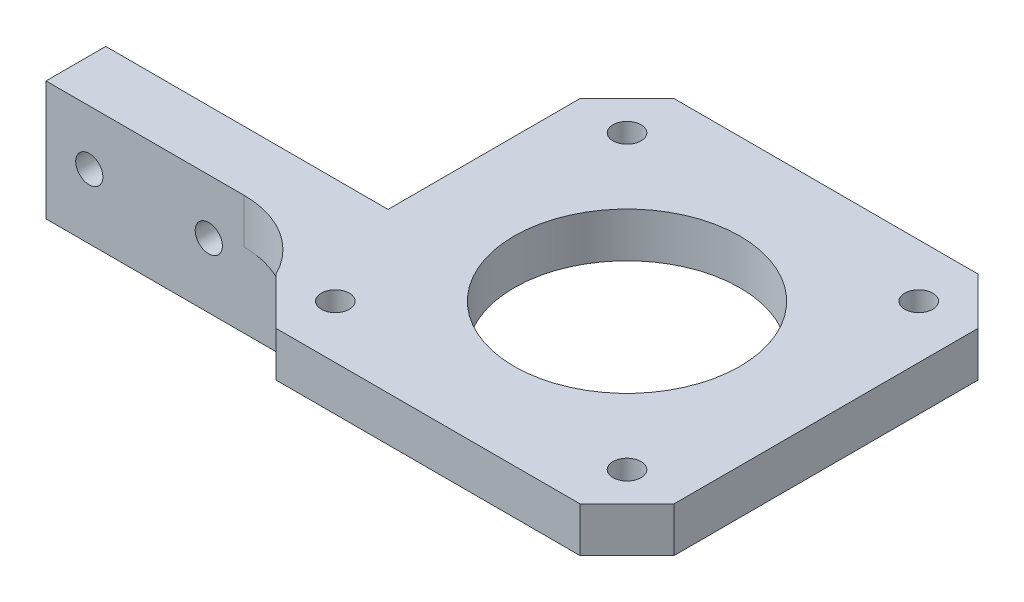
ISO-10303-21;
HEADER;
FILE_DESCRIPTION(('STEP AP214'),'2;1');
FILE_NAME('part.step','',(''),(''),'','','');
FILE_SCHEMA(('AUTOMOTIVE_DESIGN { 1 0 10303 214 1 1 1 1 }'));
ENDSEC;
DATA;
#1=APPLICATION_CONTEXT('core data for automotive mechanical design processes');
#2=APPLICATION_PROTOCOL_DEFINITION('international standard','automotive_design',2000,#1);
#3=PRODUCT_CONTEXT('',#1,'mechanical');
#4=PRODUCT('Part','Part','',(#3));
#5=PRODUCT_RELATED_PRODUCT_CATEGORY('part','',(#4));
#6=PRODUCT_DEFINITION_FORMATION('','',#4);
#7=PRODUCT_DEFINITION_CONTEXT('part definition',#1,'design');
#8=PRODUCT_DEFINITION('design','',#6,#7);
#9=PRODUCT_DEFINITION_SHAPE('','',#8);
#10=(LENGTH_UNIT() NAMED_UNIT(*) SI_UNIT(.MILLI.,.METRE.));
#11=(NAMED_UNIT(*) PLANE_ANGLE_UNIT() SI_UNIT($,.RADIAN.));
#12=(NAMED_UNIT(*) SI_UNIT($,.STERADIAN.) SOLID_ANGLE_UNIT());
#13=UNCERTAINTY_MEASURE_WITH_UNIT(LENGTH_MEASURE(1.E-05),#10,'distance_accuracy_value','');
#14=(GEOMETRIC_REPRESENTATION_CONTEXT(3) GLOBAL_UNCERTAINTY_ASSIGNED_CONTEXT((#13)) GLOBAL_UNIT_ASSIGNED_CONTEXT((#10,
#11,#12)) REPRESENTATION_CONTEXT('',''));
#15=CARTESIAN_POINT('',(0.,0.,0.));
#16=DIRECTION('',(0.,0.,1.));
#17=DIRECTION('',(1.,0.,0.));
#18=AXIS2_PLACEMENT_3D('',#15,#16,#17);
#19=CARTESIAN_POINT('',(-21.15,-4.7625,-16.15));
#20=DIRECTION('',(1.,0.,0.));
#21=DIRECTION('',(0.,0.,-1.));
#22=AXIS2_PLACEMENT_3D('',#19,#20,#21);
#23=PLANE('',#22);
#24=DIRECTION('',(0.,1.,0.));
#25=VECTOR('',#24,1.);
#26=CARTESIAN_POINT('',(-21.15,0.,4.24999999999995));
#27=LINE('',#26,#25);
#28=CARTESIAN_POINT('',(-21.15,-4.7625,4.24999999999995));
#29=VERTEX_POINT('',#28);
#30=CARTESIAN_POINT('',(-21.15,0.,4.24999999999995));
#31=VERTEX_POINT('',#30);
#32=EDGE_CURVE('E273',#29,#31,#27,.T.);
#33=ORIENTED_EDGE('',*,*,#32,.T.);
#34=DIRECTION('',(0.,0.,1.));
#35=VECTOR('',#34,1.);
#36=CARTESIAN_POINT('',(-21.15,0.,-16.15));
#37=LINE('',#36,#35);
#38=CARTESIAN_POINT('',(-21.15,0.,-16.15));
#39=VERTEX_POINT('',#38);
#40=EDGE_CURVE('E176',#39,#31,#37,.T.);
#41=ORIENTED_EDGE('',*,*,#40,.F.);
#42=DIRECTION('',(0.,1.,0.));
#43=VECTOR('',#42,1.);
#44=CARTESIAN_POINT('',(-21.15,-4.7625,-16.15));
#45=LINE('',#44,#43);
#46=CARTESIAN_POINT('',(-21.15,-4.7625,-16.15));
#47=VERTEX_POINT('',#46);
#48=EDGE_CURVE('E262',#47,#39,#45,.T.);
#49=ORIENTED_EDGE('',*,*,#48,.F.);
#50=DIRECTION('',(0.,0.,1.));
#51=VECTOR('',#50,1.);
#52=CARTESIAN_POINT('',(-21.15,-4.7625,-16.15));
#53=LINE('',#52,#51);
#54=EDGE_CURVE('E230',#47,#29,#53,.T.);
#55=ORIENTED_EDGE('',*,*,#54,.T.);
#56=EDGE_LOOP('',(#33,#41,#49,#55));
#57=FACE_BOUND('',#56,.T.);
#58=ADVANCED_FACE('F45',(#57),#23,.F.);
#59=CARTESIAN_POINT('',(0.,-4.7625,0.));
#60=DIRECTION('',(0.,-1.,0.));
#61=DIRECTION('',(0.,0.,1.));
#62=AXIS2_PLACEMENT_3D('',#59,#60,#61);
#63=PLANE('',#62);
#64=CARTESIAN_POINT('',(15.5,-4.7625,15.5));
#65=DIRECTION('',(0.,1.,0.));
#66=DIRECTION('',(0.,0.,1.));
#67=AXIS2_PLACEMENT_3D('',#64,#65,#66);
#68=CIRCLE('',#67,1.49);
#69=CARTESIAN_POINT('',(15.5,-4.7625,14.01));
#70=VERTEX_POINT('',#69);
#71=EDGE_CURVE('E191',#70,#70,#68,.T.);
#72=ORIENTED_EDGE('',*,*,#71,.T.);
#73=EDGE_LOOP('',(#72));
#74=FACE_BOUND('',#73,.T.);
#75=CARTESIAN_POINT('',(-15.5,-4.7625,-15.5));
#76=DIRECTION('',(0.,1.,0.));
#77=DIRECTION('',(0.,0.,1.));
#78=AXIS2_PLACEMENT_3D('',#75,#76,#77);
#79=CIRCLE('',#78,1.49);
#80=CARTESIAN_POINT('',(-15.5,-4.7625,-16.99));
#81=VERTEX_POINT('',#80);
#82=EDGE_CURVE('E203',#81,#81,#79,.T.);
#83=ORIENTED_EDGE('',*,*,#82,.T.);
#84=EDGE_LOOP('',(#83));
#85=FACE_BOUND('',#84,.T.);
#86=DIRECTION('',(0.,0.,1.));
#87=VECTOR('',#86,1.);
#88=CARTESIAN_POINT('',(-11.3650067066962,-4.7625,10.6));
#89=LINE('',#88,#87);
#90=CARTESIAN_POINT('',(-11.3650067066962,-4.7625,4.24999999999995));
#91=VERTEX_POINT('',#90);
#92=CARTESIAN_POINT('',(-11.3650067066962,-4.7625,10.6));
#93=VERTEX_POINT('',#92);
#94=EDGE_CURVE('E285',#91,#93,#89,.T.);
#95=ORIENTED_EDGE('',*,*,#94,.F.);
#96=DIRECTION('',(1.,0.,0.));
#97=VECTOR('',#96,1.);
#98=CARTESIAN_POINT('',(0.,-4.7625,4.24999999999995));
#99=LINE('',#98,#97);
#100=EDGE_CURVE('E62',#29,#91,#99,.T.);
#101=ORIENTED_EDGE('',*,*,#100,.F.);
#102=ORIENTED_EDGE('',*,*,#54,.F.);
#103=DIRECTION('',(-0.707106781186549,0.,0.707106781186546));
#104=VECTOR('',#103,1.);
#105=CARTESIAN_POINT('',(-16.15,-4.7625,-21.15));
#106=LINE('',#105,#104);
#107=CARTESIAN_POINT('',(-16.15,-4.7625,-21.15));
#108=VERTEX_POINT('',#107);
#109=EDGE_CURVE('E228',#108,#47,#106,.T.);
#110=ORIENTED_EDGE('',*,*,#109,.F.);
#111=DIRECTION('',(-1.,0.,0.));
#112=VECTOR('',#111,1.);
#113=CARTESIAN_POINT('',(16.15,-4.7625,-21.15));
#114=LINE('',#113,#112);
#115=CARTESIAN_POINT('',(16.15,-4.7625,-21.15));
#116=VERTEX_POINT('',#115);
#117=EDGE_CURVE('E225',#116,#108,#114,.T.);
#118=ORIENTED_EDGE('',*,*,#117,.F.);
#119=DIRECTION('',(-0.707106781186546,0.,-0.707106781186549));
#120=VECTOR('',#119,1.);
#121=CARTESIAN_POINT('',(21.15,-4.7625,-16.15));
#122=LINE('',#121,#120);
#123=CARTESIAN_POINT('',(21.15,-4.7625,-16.15));
#124=VERTEX_POINT('',#123);
#125=EDGE_CURVE('E222',#124,#116,#122,.T.);
#126=ORIENTED_EDGE('',*,*,#125,.F.);
#127=DIRECTION('',(0.,0.,-1.));
#128=VECTOR('',#127,1.);
#129=CARTESIAN_POINT('',(21.15,-4.7625,16.15));
#130=LINE('',#129,#128);
#131=CARTESIAN_POINT('',(21.15,-4.7625,16.15));
#132=VERTEX_POINT('',#131);
#133=EDGE_CURVE('E218',#132,#124,#130,.T.);
#134=ORIENTED_EDGE('',*,*,#133,.F.);
#135=DIRECTION('',(0.707106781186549,0.,-0.707106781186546));
#136=VECTOR('',#135,1.);
#137=CARTESIAN_POINT('',(16.15,-4.7625,21.15));
#138=LINE('',#137,#136);
#139=CARTESIAN_POINT('',(16.15,-4.7625,21.15));
#140=VERTEX_POINT('',#139);
#141=EDGE_CURVE('E215',#140,#132,#138,.T.);
#142=ORIENTED_EDGE('',*,*,#141,.F.);
#143=DIRECTION('',(1.,0.,0.));
#144=VECTOR('',#143,1.);
#145=CARTESIAN_POINT('',(-16.15,-4.7625,21.15));
#146=LINE('',#145,#144);
#147=CARTESIAN_POINT('',(-16.15,-4.7625,21.15));
#148=VERTEX_POINT('',#147);
#149=EDGE_CURVE('E235',#148,#140,#146,.T.);
#150=ORIENTED_EDGE('',*,*,#149,.F.);
#151=DIRECTION('',(0.707106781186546,0.,0.707106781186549));
#152=VECTOR('',#151,1.);
#153=CARTESIAN_POINT('',(-21.15,-4.7625,16.15));
#154=LINE('',#153,#152);
#155=CARTESIAN_POINT('',(-21.15,-4.7625,16.15));
#156=VERTEX_POINT('',#155);
#157=EDGE_CURVE('E232',#156,#148,#154,.T.);
#158=ORIENTED_EDGE('',*,*,#157,.F.);
#159=CARTESIAN_POINT('',(-30.1053056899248,-4.7625,20.6));
#160=DIRECTION('',(0.,1.,0.));
#161=DIRECTION('',(0.,0.,1.));
#162=AXIS2_PLACEMENT_3D('',#159,#160,#161);
#163=CIRCLE('',#162,10.);
#164=CARTESIAN_POINT('',(-30.1053056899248,-4.7625,10.6));
#165=VERTEX_POINT('',#164);
#166=EDGE_CURVE('E278',#165,#156,#163,.F.);
#167=ORIENTED_EDGE('',*,*,#166,.F.);
#168=DIRECTION('',(1.,0.,0.));
#169=VECTOR('',#168,1.);
#170=CARTESIAN_POINT('',(-51.15,-4.7625,10.6));
#171=LINE('',#170,#169);
#172=EDGE_CURVE('E274',#165,#93,#171,.T.);
#173=ORIENTED_EDGE('',*,*,#172,.T.);
#174=EDGE_LOOP('',(#95,#101,#102,#110,#118,#126,#134,#142,#150,#158,#167,#173));
#175=FACE_BOUND('',#174,.T.);
#176=CARTESIAN_POINT('',(0.,-4.7625,0.));
#177=DIRECTION('',(0.,1.,0.));
#178=DIRECTION('',(0.,0.,1.));
#179=AXIS2_PLACEMENT_3D('',#176,#177,#178);
#180=CIRCLE('',#179,12.);
#181=CARTESIAN_POINT('',(0.,-4.7625,-12.));
#182=VERTEX_POINT('',#181);
#183=EDGE_CURVE('E209',#182,#182,#180,.T.);
#184=ORIENTED_EDGE('',*,*,#183,.T.);
#185=EDGE_LOOP('',(#184));
#186=FACE_BOUND('',#185,.T.);
#187=CARTESIAN_POINT('',(15.5,-4.7625,-15.5));
#188=DIRECTION('',(0.,1.,0.));
#189=DIRECTION('',(0.,0.,1.));
#190=AXIS2_PLACEMENT_3D('',#187,#188,#189);
#191=CIRCLE('',#190,1.49);
#192=CARTESIAN_POINT('',(15.5,-4.7625,-16.99));
#193=VERTEX_POINT('',#192);
#194=EDGE_CURVE('E197',#193,#193,#191,.T.);
#195=ORIENTED_EDGE('',*,*,#194,.T.);
#196=EDGE_LOOP('',(#195));
#197=FACE_BOUND('',#196,.T.);
#198=CARTESIAN_POINT('',(-15.5,-4.7625,15.5));
#199=DIRECTION('',(0.,1.,0.));
#200=DIRECTION('',(0.,0.,1.));
#201=AXIS2_PLACEMENT_3D('',#198,#199,#200);
#202=CIRCLE('',#201,1.49);
#203=CARTESIAN_POINT('',(-15.5,-4.7625,14.01));
#204=VERTEX_POINT('',#203);
#205=EDGE_CURVE('E182',#204,#204,#202,.T.);
#206=ORIENTED_EDGE('',*,*,#205,.T.);
#207=EDGE_LOOP('',(#206));
#208=FACE_BOUND('',#207,.T.);
#209=ADVANCED_FACE('F311',(#74,#85,#175,#186,#197,#208),#63,.T.);
#210=CARTESIAN_POINT('',(0.,0.,0.));
#211=DIRECTION('',(0.,-1.,0.));
#212=DIRECTION('',(0.,0.,1.));
#213=AXIS2_PLACEMENT_3D('',#210,#211,#212);
#214=PLANE('',#213);
#215=DIRECTION('',(0.707106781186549,0.,-0.707106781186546));
#216=VECTOR('',#215,1.);
#217=CARTESIAN_POINT('',(16.15,0.,21.15));
#218=LINE('',#217,#216);
#219=CARTESIAN_POINT('',(16.15,0.,21.15));
#220=VERTEX_POINT('',#219);
#221=CARTESIAN_POINT('',(21.15,0.,16.15));
#222=VERTEX_POINT('',#221);
#223=EDGE_CURVE('E212',#220,#222,#218,.T.);
#224=ORIENTED_EDGE('',*,*,#223,.T.);
#225=DIRECTION('',(0.,0.,-1.));
#226=VECTOR('',#225,1.);
#227=CARTESIAN_POINT('',(21.15,0.,16.15));
#228=LINE('',#227,#226);
#229=CARTESIAN_POINT('',(21.15,0.,-16.15));
#230=VERTEX_POINT('',#229);
#231=EDGE_CURVE('E240',#222,#230,#228,.T.);
#232=ORIENTED_EDGE('',*,*,#231,.T.);
#233=DIRECTION('',(-0.707106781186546,0.,-0.707106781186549));
#234=VECTOR('',#233,1.);
#235=CARTESIAN_POINT('',(21.15,0.,-16.15));
#236=LINE('',#235,#234);
#237=CARTESIAN_POINT('',(16.15,0.,-21.15));
#238=VERTEX_POINT('',#237);
#239=EDGE_CURVE('E243',#230,#238,#236,.T.);
#240=ORIENTED_EDGE('',*,*,#239,.T.);
#241=DIRECTION('',(-1.,0.,0.));
#242=VECTOR('',#241,1.);
#243=CARTESIAN_POINT('',(16.15,0.,-21.15));
#244=LINE('',#243,#242);
#245=CARTESIAN_POINT('',(-16.15,0.,-21.15));
#246=VERTEX_POINT('',#245);
#247=EDGE_CURVE('E246',#238,#246,#244,.T.);
#248=ORIENTED_EDGE('',*,*,#247,.T.);
#249=DIRECTION('',(-0.707106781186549,0.,0.707106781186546));
#250=VECTOR('',#249,1.);
#251=CARTESIAN_POINT('',(-16.15,0.,-21.15));
#252=LINE('',#251,#250);
#253=EDGE_CURVE('E249',#246,#39,#252,.T.);
#254=ORIENTED_EDGE('',*,*,#253,.T.);
#255=ORIENTED_EDGE('',*,*,#40,.T.);
#256=DIRECTION('',(1.,0.,0.));
#257=VECTOR('',#256,1.);
#258=CARTESIAN_POINT('',(-51.15,0.,4.24999999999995));
#259=LINE('',#258,#257);
#260=CARTESIAN_POINT('',(-51.15,0.,4.24999999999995));
#261=VERTEX_POINT('',#260);
#262=EDGE_CURVE('E155',#261,#31,#259,.T.);
#263=ORIENTED_EDGE('',*,*,#262,.F.);
#264=DIRECTION('',(0.,0.,1.));
#265=VECTOR('',#264,1.);
#266=CARTESIAN_POINT('',(-51.15,0.,4.24999999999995));
#267=LINE('',#266,#265);
#268=CARTESIAN_POINT('',(-51.15,0.,10.6));
#269=VERTEX_POINT('',#268);
#270=EDGE_CURVE('E161',#261,#269,#267,.T.);
#271=ORIENTED_EDGE('',*,*,#270,.T.);
#272=DIRECTION('',(1.,0.,0.));
#273=VECTOR('',#272,1.);
#274=CARTESIAN_POINT('',(-51.15,0.,10.6));
#275=LINE('',#274,#273);
#276=CARTESIAN_POINT('',(-30.1053056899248,0.,10.6));
#277=VERTEX_POINT('',#276);
#278=EDGE_CURVE('E179',#269,#277,#275,.T.);
#279=ORIENTED_EDGE('',*,*,#278,.T.);
#280=CARTESIAN_POINT('',(-30.1053056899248,0.,20.6));
#281=DIRECTION('',(0.,1.,0.));
#282=DIRECTION('',(0.,0.,1.));
#283=AXIS2_PLACEMENT_3D('',#280,#281,#282);
#284=CIRCLE('',#283,10.);
#285=CARTESIAN_POINT('',(-21.15,0.,16.15));
#286=VERTEX_POINT('',#285);
#287=EDGE_CURVE('E281',#286,#277,#284,.T.);
#288=ORIENTED_EDGE('',*,*,#287,.F.);
#289=DIRECTION('',(0.707106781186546,0.,0.707106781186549));
#290=VECTOR('',#289,1.);
#291=CARTESIAN_POINT('',(-21.15,0.,16.15));
#292=LINE('',#291,#290);
#293=CARTESIAN_POINT('',(-16.15,0.,21.15));
#294=VERTEX_POINT('',#293);
#295=EDGE_CURVE('E252',#286,#294,#292,.T.);
#296=ORIENTED_EDGE('',*,*,#295,.T.);
#297=DIRECTION('',(1.,0.,0.));
#298=VECTOR('',#297,1.);
#299=CARTESIAN_POINT('',(-16.15,0.,21.15));
#300=LINE('',#299,#298);
#301=EDGE_CURVE('E219',#294,#220,#300,.T.);
#302=ORIENTED_EDGE('',*,*,#301,.T.);
#303=EDGE_LOOP('',(#224,#232,#240,#248,#254,#255,#263,#271,#279,#288,#296,#302));
#304=FACE_BOUND('',#303,.T.);
#305=CARTESIAN_POINT('',(0.,0.,0.));
#306=DIRECTION('',(0.,1.,0.));
#307=DIRECTION('',(0.,0.,1.));
#308=AXIS2_PLACEMENT_3D('',#305,#306,#307);
#309=CIRCLE('',#308,12.);
#310=CARTESIAN_POINT('',(0.,0.,-12.));
#311=VERTEX_POINT('',#310);
#312=EDGE_CURVE('E206',#311,#311,#309,.T.);
#313=ORIENTED_EDGE('',*,*,#312,.F.);
#314=EDGE_LOOP('',(#313));
#315=FACE_BOUND('',#314,.T.);
#316=CARTESIAN_POINT('',(-15.5,0.,-15.5));
#317=DIRECTION('',(0.,1.,0.));
#318=DIRECTION('',(0.,0.,1.));
#319=AXIS2_PLACEMENT_3D('',#316,#317,#318);
#320=CIRCLE('',#319,1.49);
#321=CARTESIAN_POINT('',(-15.5,0.,-16.99));
#322=VERTEX_POINT('',#321);
#323=EDGE_CURVE('E200',#322,#322,#320,.T.);
#324=ORIENTED_EDGE('',*,*,#323,.F.);
#325=EDGE_LOOP('',(#324));
#326=FACE_BOUND('',#325,.T.);
#327=CARTESIAN_POINT('',(15.5,0.,-15.5));
#328=DIRECTION('',(0.,1.,0.));
#329=DIRECTION('',(0.,0.,1.));
#330=AXIS2_PLACEMENT_3D('',#327,#328,#329);
#331=CIRCLE('',#330,1.49);
#332=CARTESIAN_POINT('',(15.5,0.,-16.99));
#333=VERTEX_POINT('',#332);
#334=EDGE_CURVE('E194',#333,#333,#331,.T.);
#335=ORIENTED_EDGE('',*,*,#334,.F.);
#336=EDGE_LOOP('',(#335));
#337=FACE_BOUND('',#336,.T.);
#338=CARTESIAN_POINT('',(15.5,0.,15.5));
#339=DIRECTION('',(0.,1.,0.));
#340=DIRECTION('',(0.,0.,1.));
#341=AXIS2_PLACEMENT_3D('',#338,#339,#340);
#342=CIRCLE('',#341,1.49);
#343=CARTESIAN_POINT('',(15.5,0.,14.01));
#344=VERTEX_POINT('',#343);
#345=EDGE_CURVE('E189',#344,#344,#342,.T.);
#346=ORIENTED_EDGE('',*,*,#345,.F.);
#347=EDGE_LOOP('',(#346));
#348=FACE_BOUND('',#347,.T.);
#349=CARTESIAN_POINT('',(-15.5,0.,15.5));
#350=DIRECTION('',(0.,1.,0.));
#351=DIRECTION('',(0.,0.,1.));
#352=AXIS2_PLACEMENT_3D('',#349,#350,#351);
#353=CIRCLE('',#352,1.49);
#354=CARTESIAN_POINT('',(-15.5,0.,14.01));
#355=VERTEX_POINT('',#354);
#356=EDGE_CURVE('E178',#355,#355,#353,.T.);
#357=ORIENTED_EDGE('',*,*,#356,.F.);
#358=EDGE_LOOP('',(#357));
#359=FACE_BOUND('',#358,.T.);
#360=ADVANCED_FACE('F173',(#304,#315,#326,#337,#348,#359),#214,.F.);
#361=CARTESIAN_POINT('',(16.15,-4.7625,21.15));
#362=DIRECTION('',(-0.707106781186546,0.,-0.707106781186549));
#363=DIRECTION('',(-0.707106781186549,0.,0.707106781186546));
#364=AXIS2_PLACEMENT_3D('',#361,#362,#363);
#365=PLANE('',#364);
#366=ORIENTED_EDGE('',*,*,#223,.F.);
#367=DIRECTION('',(0.,1.,0.));
#368=VECTOR('',#367,1.);
#369=CARTESIAN_POINT('',(16.15,-4.7625,21.15));
#370=LINE('',#369,#368);
#371=EDGE_CURVE('E238',#140,#220,#370,.T.);
#372=ORIENTED_EDGE('',*,*,#371,.F.);
#373=ORIENTED_EDGE('',*,*,#141,.T.);
#374=DIRECTION('',(0.,1.,0.));
#375=VECTOR('',#374,1.);
#376=CARTESIAN_POINT('',(21.15,-4.7625,16.15));
#377=LINE('',#376,#375);
#378=EDGE_CURVE('E271',#132,#222,#377,.T.);
#379=ORIENTED_EDGE('',*,*,#378,.T.);
#380=EDGE_LOOP('',(#366,#372,#373,#379));
#381=FACE_BOUND('',#380,.T.);
#382=ADVANCED_FACE('F328',(#381),#365,.F.);
#383=CARTESIAN_POINT('',(21.15,-4.7625,16.15));
#384=DIRECTION('',(-1.,0.,0.));
#385=DIRECTION('',(0.,0.,1.));
#386=AXIS2_PLACEMENT_3D('',#383,#384,#385);
#387=PLANE('',#386);
#388=ORIENTED_EDGE('',*,*,#231,.F.);
#389=ORIENTED_EDGE('',*,*,#378,.F.);
#390=ORIENTED_EDGE('',*,*,#133,.T.);
#391=DIRECTION('',(0.,1.,0.));
#392=VECTOR('',#391,1.);
#393=CARTESIAN_POINT('',(21.15,-4.7625,-16.15));
#394=LINE('',#393,#392);
#395=EDGE_CURVE('E269',#124,#230,#394,.T.);
#396=ORIENTED_EDGE('',*,*,#395,.T.);
#397=EDGE_LOOP('',(#388,#389,#390,#396));
#398=FACE_BOUND('',#397,.T.);
#399=ADVANCED_FACE('F333',(#398),#387,.F.);
#400=CARTESIAN_POINT('',(21.15,-4.7625,-16.15));
#401=DIRECTION('',(-0.707106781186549,0.,0.707106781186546));
#402=DIRECTION('',(0.707106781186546,0.,0.707106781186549));
#403=AXIS2_PLACEMENT_3D('',#400,#401,#402);
#404=PLANE('',#403);
#405=ORIENTED_EDGE('',*,*,#239,.F.);
#406=ORIENTED_EDGE('',*,*,#395,.F.);
#407=ORIENTED_EDGE('',*,*,#125,.T.);
#408=DIRECTION('',(0.,1.,0.));
#409=VECTOR('',#408,1.);
#410=CARTESIAN_POINT('',(16.15,-4.7625,-21.15));
#411=LINE('',#410,#409);
#412=EDGE_CURVE('E267',#116,#238,#411,.T.);
#413=ORIENTED_EDGE('',*,*,#412,.T.);
#414=EDGE_LOOP('',(#405,#406,#407,#413));
#415=FACE_BOUND('',#414,.T.);
#416=ADVANCED_FACE('F336',(#415),#404,.F.);
#417=CARTESIAN_POINT('',(16.15,-4.7625,-21.15));
#418=DIRECTION('',(0.,0.,1.));
#419=DIRECTION('',(1.,0.,0.));
#420=AXIS2_PLACEMENT_3D('',#417,#418,#419);
#421=PLANE('',#420);
#422=ORIENTED_EDGE('',*,*,#247,.F.);
#423=ORIENTED_EDGE('',*,*,#412,.F.);
#424=ORIENTED_EDGE('',*,*,#117,.T.);
#425=DIRECTION('',(0.,1.,0.));
#426=VECTOR('',#425,1.);
#427=CARTESIAN_POINT('',(-16.15,-4.7625,-21.15));
#428=LINE('',#427,#426);
#429=EDGE_CURVE('E265',#108,#246,#428,.T.);
#430=ORIENTED_EDGE('',*,*,#429,.T.);
#431=EDGE_LOOP('',(#422,#423,#424,#430));
#432=FACE_BOUND('',#431,.T.);
#433=ADVANCED_FACE('F340',(#432),#421,.F.);
#434=CARTESIAN_POINT('',(-16.15,-4.7625,-21.15));
#435=DIRECTION('',(0.707106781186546,0.,0.707106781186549));
#436=DIRECTION('',(0.707106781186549,0.,-0.707106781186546));
#437=AXIS2_PLACEMENT_3D('',#434,#435,#436);
#438=PLANE('',#437);
#439=ORIENTED_EDGE('',*,*,#253,.F.);
#440=ORIENTED_EDGE('',*,*,#429,.F.);
#441=ORIENTED_EDGE('',*,*,#109,.T.);
#442=ORIENTED_EDGE('',*,*,#48,.T.);
#443=EDGE_LOOP('',(#439,#440,#441,#442));
#444=FACE_BOUND('',#443,.T.);
#445=ADVANCED_FACE('F344',(#444),#438,.F.);
#446=CARTESIAN_POINT('',(-21.15,-4.7625,16.15));
#447=DIRECTION('',(0.707106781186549,0.,-0.707106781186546));
#448=DIRECTION('',(-0.707106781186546,0.,-0.707106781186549));
#449=AXIS2_PLACEMENT_3D('',#446,#447,#448);
#450=PLANE('',#449);
#451=ORIENTED_EDGE('',*,*,#295,.F.);
#452=DIRECTION('',(0.,1.,0.));
#453=VECTOR('',#452,1.);
#454=CARTESIAN_POINT('',(-21.15,-4.7625,16.15));
#455=LINE('',#454,#453);
#456=EDGE_CURVE('E260',#156,#286,#455,.T.);
#457=ORIENTED_EDGE('',*,*,#456,.F.);
#458=ORIENTED_EDGE('',*,*,#157,.T.);
#459=DIRECTION('',(0.,1.,0.));
#460=VECTOR('',#459,1.);
#461=CARTESIAN_POINT('',(-16.15,-4.7625,21.15));
#462=LINE('',#461,#460);
#463=EDGE_CURVE('E258',#148,#294,#462,.T.);
#464=ORIENTED_EDGE('',*,*,#463,.T.);
#465=EDGE_LOOP('',(#451,#457,#458,#464));
#466=FACE_BOUND('',#465,.T.);
#467=ADVANCED_FACE('F322',(#466),#450,.F.);
#468=CARTESIAN_POINT('',(-16.15,-4.7625,21.15));
#469=DIRECTION('',(0.,0.,-1.));
#470=DIRECTION('',(-1.,0.,0.));
#471=AXIS2_PLACEMENT_3D('',#468,#469,#470);
#472=PLANE('',#471);
#473=ORIENTED_EDGE('',*,*,#301,.F.);
#474=ORIENTED_EDGE('',*,*,#463,.F.);
#475=ORIENTED_EDGE('',*,*,#149,.T.);
#476=ORIENTED_EDGE('',*,*,#371,.T.);
#477=EDGE_LOOP('',(#473,#474,#475,#476));
#478=FACE_BOUND('',#477,.T.);
#479=ADVANCED_FACE('F325',(#478),#472,.F.);
#480=CARTESIAN_POINT('',(0.,-4.7625,0.));
#481=DIRECTION('',(0.,1.,0.));
#482=DIRECTION('',(0.,0.,-1.));
#483=AXIS2_PLACEMENT_3D('',#480,#481,#482);
#484=CYLINDRICAL_SURFACE('',#483,12.);
#485=CARTESIAN_POINT('',(0.,-4.7625,-12.));
#486=CARTESIAN_POINT('',(0.,-4.712890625,-12.));
#487=CARTESIAN_POINT('',(0.,-4.66328125,-12.));
#488=CARTESIAN_POINT('',(0.,-4.5640625,-12.));
#489=CARTESIAN_POINT('',(0.,-4.514453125,-12.));
#490=CARTESIAN_POINT('',(0.,-4.415234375,-12.));
#491=CARTESIAN_POINT('',(0.,-4.365625,-12.));
#492=CARTESIAN_POINT('',(0.,-4.26640625,-12.));
#493=CARTESIAN_POINT('',(0.,-4.216796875,-12.));
#494=CARTESIAN_POINT('',(0.,-4.117578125,-12.));
#495=CARTESIAN_POINT('',(0.,-4.06796875,-12.));
#496=CARTESIAN_POINT('',(0.,-3.96875,-12.));
#497=CARTESIAN_POINT('',(0.,-3.919140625,-12.));
#498=CARTESIAN_POINT('',(0.,-3.819921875,-12.));
#499=CARTESIAN_POINT('',(0.,-3.7703125,-12.));
#500=CARTESIAN_POINT('',(0.,-3.67109375,-12.));
#501=CARTESIAN_POINT('',(0.,-3.621484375,-12.));
#502=CARTESIAN_POINT('',(0.,-3.522265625,-12.));
#503=CARTESIAN_POINT('',(0.,-3.47265625,-12.));
#504=CARTESIAN_POINT('',(0.,-3.3734375,-12.));
#505=CARTESIAN_POINT('',(0.,-3.323828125,-12.));
#506=CARTESIAN_POINT('',(0.,-3.224609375,-12.));
#507=CARTESIAN_POINT('',(0.,-3.175,-12.));
#508=CARTESIAN_POINT('',(0.,-3.07578125,-12.));
#509=CARTESIAN_POINT('',(0.,-3.026171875,-12.));
#510=CARTESIAN_POINT('',(0.,-2.926953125,-12.));
#511=CARTESIAN_POINT('',(0.,-2.87734375,-12.));
#512=CARTESIAN_POINT('',(0.,-2.778125,-12.));
#513=CARTESIAN_POINT('',(0.,-2.728515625,-12.));
#514=CARTESIAN_POINT('',(0.,-2.629296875,-12.));
#515=CARTESIAN_POINT('',(0.,-2.5796875,-12.));
#516=CARTESIAN_POINT('',(0.,-2.48046875,-12.));
#517=CARTESIAN_POINT('',(0.,-2.430859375,-12.));
#518=CARTESIAN_POINT('',(0.,-2.331640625,-12.));
#519=CARTESIAN_POINT('',(0.,-2.28203125,-12.));
#520=CARTESIAN_POINT('',(0.,-2.1828125,-12.));
#521=CARTESIAN_POINT('',(0.,-2.133203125,-12.));
#522=CARTESIAN_POINT('',(0.,-2.033984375,-12.));
#523=CARTESIAN_POINT('',(0.,-1.984375,-12.));
#524=CARTESIAN_POINT('',(0.,-1.88515625,-12.));
#525=CARTESIAN_POINT('',(0.,-1.835546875,-12.));
#526=CARTESIAN_POINT('',(0.,-1.736328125,-12.));
#527=CARTESIAN_POINT('',(0.,-1.68671875,-12.));
#528=CARTESIAN_POINT('',(0.,-1.5875,-12.));
#529=CARTESIAN_POINT('',(0.,-1.537890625,-12.));
#530=CARTESIAN_POINT('',(0.,-1.438671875,-12.));
#531=CARTESIAN_POINT('',(0.,-1.3890625,-12.));
#532=CARTESIAN_POINT('',(0.,-1.28984375,-12.));
#533=CARTESIAN_POINT('',(0.,-1.240234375,-12.));
#534=CARTESIAN_POINT('',(0.,-1.141015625,-12.));
#535=CARTESIAN_POINT('',(0.,-1.09140625,-12.));
#536=CARTESIAN_POINT('',(0.,-0.9921875,-12.));
#537=CARTESIAN_POINT('',(0.,-0.942578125,-12.));
#538=CARTESIAN_POINT('',(0.,-0.843359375,-12.));
#539=CARTESIAN_POINT('',(0.,-0.79375,-12.));
#540=CARTESIAN_POINT('',(0.,-0.69453125,-12.));
#541=CARTESIAN_POINT('',(0.,-0.644921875,-12.));
#542=CARTESIAN_POINT('',(0.,-0.545703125,-12.));
#543=CARTESIAN_POINT('',(0.,-0.49609375,-12.));
#544=CARTESIAN_POINT('',(0.,-0.396875,-12.));
#545=CARTESIAN_POINT('',(0.,-0.347265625,-12.));
#546=CARTESIAN_POINT('',(0.,-0.248046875,-12.));
#547=CARTESIAN_POINT('',(0.,-0.1984375,-12.));
#548=CARTESIAN_POINT('',(0.,-0.09921875,-12.));
#549=CARTESIAN_POINT('',(0.,-0.049609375,-12.));
#550=CARTESIAN_POINT('',(0.,0.,-12.));
#551=B_SPLINE_CURVE_WITH_KNOTS('',3,(#485,#486,#487,#488,#489,#490,#491,#492,#493,#494,#495,
#496,#497,#498,#499,#500,#501,#502,#503,#504,#505,#506,#507,#508,#509,#510,#511,#512,#513,#514,
#515,#516,#517,#518,#519,#520,#521,#522,#523,#524,#525,#526,#527,#528,#529,#530,#531,#532,#533,
#534,#535,#536,#537,#538,#539,#540,#541,#542,#543,#544,#545,#546,#547,#548,#549,#550),
.UNSPECIFIED.,.F.,.F.,(4,2,2,2,2,2,2,2,2,2,2,2,2,2,2,2,2,2,2,2,2,2,2,2,2,2,2,2,2,2,2,2,4),(0.,
0.148828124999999,0.297656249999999,0.446484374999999,0.595312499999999,0.744140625,0.89296875,
1.041796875,1.190625,1.339453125,1.48828125,1.637109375,1.7859375,1.934765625,2.08359375,
2.232421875,2.38125,2.530078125,2.67890625,2.827734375,2.9765625,3.125390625,3.27421875,
3.423046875,3.571875,3.720703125,3.86953125,4.018359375,4.1671875,4.316015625,4.46484375,
4.613671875,4.7625),.UNSPECIFIED.);
#552=EDGE_CURVE('BSEAM401',#182,#311,#551,.T.);
#553=ORIENTED_EDGE('',*,*,#183,.F.);
#554=ORIENTED_EDGE('',*,*,#312,.T.);
#555=ORIENTED_EDGE('',*,*,#552,.T.);
#556=ORIENTED_EDGE('',*,*,#552,.F.);
#557=EDGE_LOOP('',(#553,#555,#554,#556));
#558=FACE_BOUND('',#557,.T.);
#559=ADVANCED_FACE('F401',(#558),#484,.F.);
#560=CARTESIAN_POINT('',(-15.5,-4.7625,-15.5));
#561=DIRECTION('',(0.,1.,0.));
#562=DIRECTION('',(0.,0.,-1.));
#563=AXIS2_PLACEMENT_3D('',#560,#561,#562);
#564=CYLINDRICAL_SURFACE('',#563,1.49);
#565=CARTESIAN_POINT('',(-15.5,-4.7625,-16.99));
#566=CARTESIAN_POINT('',(-15.5,-4.712890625,-16.99));
#567=CARTESIAN_POINT('',(-15.5,-4.66328125,-16.99));
#568=CARTESIAN_POINT('',(-15.5,-4.5640625,-16.99));
#569=CARTESIAN_POINT('',(-15.5,-4.514453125,-16.99));
#570=CARTESIAN_POINT('',(-15.5,-4.415234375,-16.99));
#571=CARTESIAN_POINT('',(-15.5,-4.365625,-16.99));
#572=CARTESIAN_POINT('',(-15.5,-4.26640625,-16.99));
#573=CARTESIAN_POINT('',(-15.5,-4.216796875,-16.99));
#574=CARTESIAN_POINT('',(-15.5,-4.117578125,-16.99));
#575=CARTESIAN_POINT('',(-15.5,-4.06796875,-16.99));
#576=CARTESIAN_POINT('',(-15.5,-3.96875,-16.99));
#577=CARTESIAN_POINT('',(-15.5,-3.919140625,-16.99));
#578=CARTESIAN_POINT('',(-15.5,-3.819921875,-16.99));
#579=CARTESIAN_POINT('',(-15.5,-3.7703125,-16.99));
#580=CARTESIAN_POINT('',(-15.5,-3.67109375,-16.99));
#581=CARTESIAN_POINT('',(-15.5,-3.621484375,-16.99));
#582=CARTESIAN_POINT('',(-15.5,-3.522265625,-16.99));
#583=CARTESIAN_POINT('',(-15.5,-3.47265625,-16.99));
#584=CARTESIAN_POINT('',(-15.5,-3.3734375,-16.99));
#585=CARTESIAN_POINT('',(-15.5,-3.323828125,-16.99));
#586=CARTESIAN_POINT('',(-15.5,-3.224609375,-16.99));
#587=CARTESIAN_POINT('',(-15.5,-3.175,-16.99));
#588=CARTESIAN_POINT('',(-15.5,-3.07578125,-16.99));
#589=CARTESIAN_POINT('',(-15.5,-3.026171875,-16.99));
#590=CARTESIAN_POINT('',(-15.5,-2.926953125,-16.99));
#591=CARTESIAN_POINT('',(-15.5,-2.87734375,-16.99));
#592=CARTESIAN_POINT('',(-15.5,-2.778125,-16.99));
#593=CARTESIAN_POINT('',(-15.5,-2.728515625,-16.99));
#594=CARTESIAN_POINT('',(-15.5,-2.629296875,-16.99));
#595=CARTESIAN_POINT('',(-15.5,-2.5796875,-16.99));
#596=CARTESIAN_POINT('',(-15.5,-2.48046875,-16.99));
#597=CARTESIAN_POINT('',(-15.5,-2.430859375,-16.99));
#598=CARTESIAN_POINT('',(-15.5,-2.331640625,-16.99));
#599=CARTESIAN_POINT('',(-15.5,-2.28203125,-16.99));
#600=CARTESIAN_POINT('',(-15.5,-2.1828125,-16.99));
#601=CARTESIAN_POINT('',(-15.5,-2.133203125,-16.99));
#602=CARTESIAN_POINT('',(-15.5,-2.033984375,-16.99));
#603=CARTESIAN_POINT('',(-15.5,-1.984375,-16.99));
#604=CARTESIAN_POINT('',(-15.5,-1.88515625,-16.99));
#605=CARTESIAN_POINT('',(-15.5,-1.835546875,-16.99));
#606=CARTESIAN_POINT('',(-15.5,-1.736328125,-16.99));
#607=CARTESIAN_POINT('',(-15.5,-1.68671875,-16.99));
#608=CARTESIAN_POINT('',(-15.5,-1.5875,-16.99));
#609=CARTESIAN_POINT('',(-15.5,-1.537890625,-16.99));
#610=CARTESIAN_POINT('',(-15.5,-1.438671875,-16.99));
#611=CARTESIAN_POINT('',(-15.5,-1.3890625,-16.99));
#612=CARTESIAN_POINT('',(-15.5,-1.28984375,-16.99));
#613=CARTESIAN_POINT('',(-15.5,-1.240234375,-16.99));
#614=CARTESIAN_POINT('',(-15.5,-1.141015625,-16.99));
#615=CARTESIAN_POINT('',(-15.5,-1.09140625,-16.99));
#616=CARTESIAN_POINT('',(-15.5,-0.9921875,-16.99));
#617=CARTESIAN_POINT('',(-15.5,-0.942578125,-16.99));
#618=CARTESIAN_POINT('',(-15.5,-0.843359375,-16.99));
#619=CARTESIAN_POINT('',(-15.5,-0.79375,-16.99));
#620=CARTESIAN_POINT('',(-15.5,-0.69453125,-16.99));
#621=CARTESIAN_POINT('',(-15.5,-0.644921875,-16.99));
#622=CARTESIAN_POINT('',(-15.5,-0.545703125,-16.99));
#623=CARTESIAN_POINT('',(-15.5,-0.49609375,-16.99));
#624=CARTESIAN_POINT('',(-15.5,-0.396875,-16.99));
#625=CARTESIAN_POINT('',(-15.5,-0.347265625,-16.99));
#626=CARTESIAN_POINT('',(-15.5,-0.248046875,-16.99));
#627=CARTESIAN_POINT('',(-15.5,-0.1984375,-16.99));
#628=CARTESIAN_POINT('',(-15.5,-0.09921875,-16.99));
#629=CARTESIAN_POINT('',(-15.5,-0.049609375,-16.99));
#630=CARTESIAN_POINT('',(-15.5,0.,-16.99));
#631=B_SPLINE_CURVE_WITH_KNOTS('',3,(#565,#566,#567,#568,#569,#570,#571,#572,#573,#574,#575,
#576,#577,#578,#579,#580,#581,#582,#583,#584,#585,#586,#587,#588,#589,#590,#591,#592,#593,#594,
#595,#596,#597,#598,#599,#600,#601,#602,#603,#604,#605,#606,#607,#608,#609,#610,#611,#612,#613,
#614,#615,#616,#617,#618,#619,#620,#621,#622,#623,#624,#625,#626,#627,#628,#629,#630),
.UNSPECIFIED.,.F.,.F.,(4,2,2,2,2,2,2,2,2,2,2,2,2,2,2,2,2,2,2,2,2,2,2,2,2,2,2,2,2,2,2,2,4),(0.,
0.148828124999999,0.297656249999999,0.446484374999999,0.595312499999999,0.744140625,0.89296875,
1.041796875,1.190625,1.339453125,1.48828125,1.637109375,1.7859375,1.934765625,2.08359375,
2.232421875,2.38125,2.530078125,2.67890625,2.827734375,2.9765625,3.125390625,3.27421875,
3.423046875,3.571875,3.720703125,3.86953125,4.018359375,4.1671875,4.316015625,4.46484375,
4.613671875,4.7625),.UNSPECIFIED.);
#632=EDGE_CURVE('BSEAM397',#81,#322,#631,.T.);
#633=ORIENTED_EDGE('',*,*,#82,.F.);
#634=ORIENTED_EDGE('',*,*,#323,.T.);
#635=ORIENTED_EDGE('',*,*,#632,.T.);
#636=ORIENTED_EDGE('',*,*,#632,.F.);
#637=EDGE_LOOP('',(#633,#635,#634,#636));
#638=FACE_BOUND('',#637,.T.);
#639=ADVANCED_FACE('F397',(#638),#564,.F.);
#640=CARTESIAN_POINT('',(15.5,-4.7625,-15.5));
#641=DIRECTION('',(0.,1.,0.));
#642=DIRECTION('',(0.,0.,-1.));
#643=AXIS2_PLACEMENT_3D('',#640,#641,#642);
#644=CYLINDRICAL_SURFACE('',#643,1.49);
#645=CARTESIAN_POINT('',(15.5,-4.7625,-16.99));
#646=CARTESIAN_POINT('',(15.5,-4.712890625,-16.99));
#647=CARTESIAN_POINT('',(15.5,-4.66328125,-16.99));
#648=CARTESIAN_POINT('',(15.5,-4.5640625,-16.99));
#649=CARTESIAN_POINT('',(15.5,-4.514453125,-16.99));
#650=CARTESIAN_POINT('',(15.5,-4.415234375,-16.99));
#651=CARTESIAN_POINT('',(15.5,-4.365625,-16.99));
#652=CARTESIAN_POINT('',(15.5,-4.26640625,-16.99));
#653=CARTESIAN_POINT('',(15.5,-4.216796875,-16.99));
#654=CARTESIAN_POINT('',(15.5,-4.117578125,-16.99));
#655=CARTESIAN_POINT('',(15.5,-4.06796875,-16.99));
#656=CARTESIAN_POINT('',(15.5,-3.96875,-16.99));
#657=CARTESIAN_POINT('',(15.5,-3.919140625,-16.99));
#658=CARTESIAN_POINT('',(15.5,-3.819921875,-16.99));
#659=CARTESIAN_POINT('',(15.5,-3.7703125,-16.99));
#660=CARTESIAN_POINT('',(15.5,-3.67109375,-16.99));
#661=CARTESIAN_POINT('',(15.5,-3.621484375,-16.99));
#662=CARTESIAN_POINT('',(15.5,-3.522265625,-16.99));
#663=CARTESIAN_POINT('',(15.5,-3.47265625,-16.99));
#664=CARTESIAN_POINT('',(15.5,-3.3734375,-16.99));
#665=CARTESIAN_POINT('',(15.5,-3.323828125,-16.99));
#666=CARTESIAN_POINT('',(15.5,-3.224609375,-16.99));
#667=CARTESIAN_POINT('',(15.5,-3.175,-16.99));
#668=CARTESIAN_POINT('',(15.5,-3.07578125,-16.99));
#669=CARTESIAN_POINT('',(15.5,-3.026171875,-16.99));
#670=CARTESIAN_POINT('',(15.5,-2.926953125,-16.99));
#671=CARTESIAN_POINT('',(15.5,-2.87734375,-16.99));
#672=CARTESIAN_POINT('',(15.5,-2.778125,-16.99));
#673=CARTESIAN_POINT('',(15.5,-2.728515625,-16.99));
#674=CARTESIAN_POINT('',(15.5,-2.629296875,-16.99));
#675=CARTESIAN_POINT('',(15.5,-2.5796875,-16.99));
#676=CARTESIAN_POINT('',(15.5,-2.48046875,-16.99));
#677=CARTESIAN_POINT('',(15.5,-2.430859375,-16.99));
#678=CARTESIAN_POINT('',(15.5,-2.331640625,-16.99));
#679=CARTESIAN_POINT('',(15.5,-2.28203125,-16.99));
#680=CARTESIAN_POINT('',(15.5,-2.1828125,-16.99));
#681=CARTESIAN_POINT('',(15.5,-2.133203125,-16.99));
#682=CARTESIAN_POINT('',(15.5,-2.033984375,-16.99));
#683=CARTESIAN_POINT('',(15.5,-1.984375,-16.99));
#684=CARTESIAN_POINT('',(15.5,-1.88515625,-16.99));
#685=CARTESIAN_POINT('',(15.5,-1.835546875,-16.99));
#686=CARTESIAN_POINT('',(15.5,-1.736328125,-16.99));
#687=CARTESIAN_POINT('',(15.5,-1.68671875,-16.99));
#688=CARTESIAN_POINT('',(15.5,-1.5875,-16.99));
#689=CARTESIAN_POINT('',(15.5,-1.537890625,-16.99));
#690=CARTESIAN_POINT('',(15.5,-1.438671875,-16.99));
#691=CARTESIAN_POINT('',(15.5,-1.3890625,-16.99));
#692=CARTESIAN_POINT('',(15.5,-1.28984375,-16.99));
#693=CARTESIAN_POINT('',(15.5,-1.240234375,-16.99));
#694=CARTESIAN_POINT('',(15.5,-1.141015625,-16.99));
#695=CARTESIAN_POINT('',(15.5,-1.09140625,-16.99));
#696=CARTESIAN_POINT('',(15.5,-0.9921875,-16.99));
#697=CARTESIAN_POINT('',(15.5,-0.942578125,-16.99));
#698=CARTESIAN_POINT('',(15.5,-0.843359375,-16.99));
#699=CARTESIAN_POINT('',(15.5,-0.79375,-16.99));
#700=CARTESIAN_POINT('',(15.5,-0.69453125,-16.99));
#701=CARTESIAN_POINT('',(15.5,-0.644921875,-16.99));
#702=CARTESIAN_POINT('',(15.5,-0.545703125,-16.99));
#703=CARTESIAN_POINT('',(15.5,-0.49609375,-16.99));
#704=CARTESIAN_POINT('',(15.5,-0.396875,-16.99));
#705=CARTESIAN_POINT('',(15.5,-0.347265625,-16.99));
#706=CARTESIAN_POINT('',(15.5,-0.248046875,-16.99));
#707=CARTESIAN_POINT('',(15.5,-0.1984375,-16.99));
#708=CARTESIAN_POINT('',(15.5,-0.09921875,-16.99));
#709=CARTESIAN_POINT('',(15.5,-0.049609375,-16.99));
#710=CARTESIAN_POINT('',(15.5,0.,-16.99));
#711=B_SPLINE_CURVE_WITH_KNOTS('',3,(#645,#646,#647,#648,#649,#650,#651,#652,#653,#654,#655,
#656,#657,#658,#659,#660,#661,#662,#663,#664,#665,#666,#667,#668,#669,#670,#671,#672,#673,#674,
#675,#676,#677,#678,#679,#680,#681,#682,#683,#684,#685,#686,#687,#688,#689,#690,#691,#692,#693,
#694,#695,#696,#697,#698,#699,#700,#701,#702,#703,#704,#705,#706,#707,#708,#709,#710),
.UNSPECIFIED.,.F.,.F.,(4,2,2,2,2,2,2,2,2,2,2,2,2,2,2,2,2,2,2,2,2,2,2,2,2,2,2,2,2,2,2,2,4),(0.,
0.148828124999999,0.297656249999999,0.446484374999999,0.595312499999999,0.744140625,0.89296875,
1.041796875,1.190625,1.339453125,1.48828125,1.637109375,1.7859375,1.934765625,2.08359375,
2.232421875,2.38125,2.530078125,2.67890625,2.827734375,2.9765625,3.125390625,3.27421875,
3.423046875,3.571875,3.720703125,3.86953125,4.018359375,4.1671875,4.316015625,4.46484375,
4.613671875,4.7625),.UNSPECIFIED.);
#712=EDGE_CURVE('BSEAM393',#193,#333,#711,.T.);
#713=ORIENTED_EDGE('',*,*,#194,.F.);
#714=ORIENTED_EDGE('',*,*,#334,.T.);
#715=ORIENTED_EDGE('',*,*,#712,.T.);
#716=ORIENTED_EDGE('',*,*,#712,.F.);
#717=EDGE_LOOP('',(#713,#715,#714,#716));
#718=FACE_BOUND('',#717,.T.);
#719=ADVANCED_FACE('F393',(#718),#644,.F.);
#720=CARTESIAN_POINT('',(15.5,-4.7625,15.5));
#721=DIRECTION('',(0.,1.,0.));
#722=DIRECTION('',(0.,0.,-1.));
#723=AXIS2_PLACEMENT_3D('',#720,#721,#722);
#724=CYLINDRICAL_SURFACE('',#723,1.49);
#725=CARTESIAN_POINT('',(15.5,-4.7625,14.01));
#726=CARTESIAN_POINT('',(15.5,-4.712890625,14.01));
#727=CARTESIAN_POINT('',(15.5,-4.66328125,14.01));
#728=CARTESIAN_POINT('',(15.5,-4.5640625,14.01));
#729=CARTESIAN_POINT('',(15.5,-4.514453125,14.01));
#730=CARTESIAN_POINT('',(15.5,-4.415234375,14.01));
#731=CARTESIAN_POINT('',(15.5,-4.365625,14.01));
#732=CARTESIAN_POINT('',(15.5,-4.26640625,14.01));
#733=CARTESIAN_POINT('',(15.5,-4.216796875,14.01));
#734=CARTESIAN_POINT('',(15.5,-4.117578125,14.01));
#735=CARTESIAN_POINT('',(15.5,-4.06796875,14.01));
#736=CARTESIAN_POINT('',(15.5,-3.96875,14.01));
#737=CARTESIAN_POINT('',(15.5,-3.919140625,14.01));
#738=CARTESIAN_POINT('',(15.5,-3.819921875,14.01));
#739=CARTESIAN_POINT('',(15.5,-3.7703125,14.01));
#740=CARTESIAN_POINT('',(15.5,-3.67109375,14.01));
#741=CARTESIAN_POINT('',(15.5,-3.621484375,14.01));
#742=CARTESIAN_POINT('',(15.5,-3.522265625,14.01));
#743=CARTESIAN_POINT('',(15.5,-3.47265625,14.01));
#744=CARTESIAN_POINT('',(15.5,-3.3734375,14.01));
#745=CARTESIAN_POINT('',(15.5,-3.323828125,14.01));
#746=CARTESIAN_POINT('',(15.5,-3.224609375,14.01));
#747=CARTESIAN_POINT('',(15.5,-3.175,14.01));
#748=CARTESIAN_POINT('',(15.5,-3.07578125,14.01));
#749=CARTESIAN_POINT('',(15.5,-3.026171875,14.01));
#750=CARTESIAN_POINT('',(15.5,-2.926953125,14.01));
#751=CARTESIAN_POINT('',(15.5,-2.87734375,14.01));
#752=CARTESIAN_POINT('',(15.5,-2.778125,14.01));
#753=CARTESIAN_POINT('',(15.5,-2.728515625,14.01));
#754=CARTESIAN_POINT('',(15.5,-2.629296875,14.01));
#755=CARTESIAN_POINT('',(15.5,-2.5796875,14.01));
#756=CARTESIAN_POINT('',(15.5,-2.48046875,14.01));
#757=CARTESIAN_POINT('',(15.5,-2.430859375,14.01));
#758=CARTESIAN_POINT('',(15.5,-2.331640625,14.01));
#759=CARTESIAN_POINT('',(15.5,-2.28203125,14.01));
#760=CARTESIAN_POINT('',(15.5,-2.1828125,14.01));
#761=CARTESIAN_POINT('',(15.5,-2.133203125,14.01));
#762=CARTESIAN_POINT('',(15.5,-2.033984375,14.01));
#763=CARTESIAN_POINT('',(15.5,-1.984375,14.01));
#764=CARTESIAN_POINT('',(15.5,-1.88515625,14.01));
#765=CARTESIAN_POINT('',(15.5,-1.835546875,14.01));
#766=CARTESIAN_POINT('',(15.5,-1.736328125,14.01));
#767=CARTESIAN_POINT('',(15.5,-1.68671875,14.01));
#768=CARTESIAN_POINT('',(15.5,-1.5875,14.01));
#769=CARTESIAN_POINT('',(15.5,-1.537890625,14.01));
#770=CARTESIAN_POINT('',(15.5,-1.438671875,14.01));
#771=CARTESIAN_POINT('',(15.5,-1.3890625,14.01));
#772=CARTESIAN_POINT('',(15.5,-1.28984375,14.01));
#773=CARTESIAN_POINT('',(15.5,-1.240234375,14.01));
#774=CARTESIAN_POINT('',(15.5,-1.141015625,14.01));
#775=CARTESIAN_POINT('',(15.5,-1.09140625,14.01));
#776=CARTESIAN_POINT('',(15.5,-0.9921875,14.01));
#777=CARTESIAN_POINT('',(15.5,-0.942578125,14.01));
#778=CARTESIAN_POINT('',(15.5,-0.843359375,14.01));
#779=CARTESIAN_POINT('',(15.5,-0.79375,14.01));
#780=CARTESIAN_POINT('',(15.5,-0.69453125,14.01));
#781=CARTESIAN_POINT('',(15.5,-0.644921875,14.01));
#782=CARTESIAN_POINT('',(15.5,-0.545703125,14.01));
#783=CARTESIAN_POINT('',(15.5,-0.49609375,14.01));
#784=CARTESIAN_POINT('',(15.5,-0.396875,14.01));
#785=CARTESIAN_POINT('',(15.5,-0.347265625,14.01));
#786=CARTESIAN_POINT('',(15.5,-0.248046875,14.01));
#787=CARTESIAN_POINT('',(15.5,-0.1984375,14.01));
#788=CARTESIAN_POINT('',(15.5,-0.09921875,14.01));
#789=CARTESIAN_POINT('',(15.5,-0.049609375,14.01));
#790=CARTESIAN_POINT('',(15.5,0.,14.01));
#791=B_SPLINE_CURVE_WITH_KNOTS('',3,(#725,#726,#727,#728,#729,#730,#731,#732,#733,#734,#735,
#736,#737,#738,#739,#740,#741,#742,#743,#744,#745,#746,#747,#748,#749,#750,#751,#752,#753,#754,
#755,#756,#757,#758,#759,#760,#761,#762,#763,#764,#765,#766,#767,#768,#769,#770,#771,#772,#773,
#774,#775,#776,#777,#778,#779,#780,#781,#782,#783,#784,#785,#786,#787,#788,#789,#790),
.UNSPECIFIED.,.F.,.F.,(4,2,2,2,2,2,2,2,2,2,2,2,2,2,2,2,2,2,2,2,2,2,2,2,2,2,2,2,2,2,2,2,4),(0.,
0.148828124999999,0.297656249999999,0.446484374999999,0.595312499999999,0.744140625,0.89296875,
1.041796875,1.190625,1.339453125,1.48828125,1.637109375,1.7859375,1.934765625,2.08359375,
2.232421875,2.38125,2.530078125,2.67890625,2.827734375,2.9765625,3.125390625,3.27421875,
3.423046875,3.571875,3.720703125,3.86953125,4.018359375,4.1671875,4.316015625,4.46484375,
4.613671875,4.7625),.UNSPECIFIED.);
#792=EDGE_CURVE('BSEAM389',#70,#344,#791,.T.);
#793=ORIENTED_EDGE('',*,*,#71,.F.);
#794=ORIENTED_EDGE('',*,*,#345,.T.);
#795=ORIENTED_EDGE('',*,*,#792,.T.);
#796=ORIENTED_EDGE('',*,*,#792,.F.);
#797=EDGE_LOOP('',(#793,#795,#794,#796));
#798=FACE_BOUND('',#797,.T.);
#799=ADVANCED_FACE('F389',(#798),#724,.F.);
#800=CARTESIAN_POINT('',(-15.5,-4.7625,15.5));
#801=DIRECTION('',(0.,1.,0.));
#802=DIRECTION('',(0.,0.,-1.));
#803=AXIS2_PLACEMENT_3D('',#800,#801,#802);
#804=CYLINDRICAL_SURFACE('',#803,1.49);
#805=CARTESIAN_POINT('',(-15.5,-4.7625,14.01));
#806=CARTESIAN_POINT('',(-15.5,-4.712890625,14.01));
#807=CARTESIAN_POINT('',(-15.5,-4.66328125,14.01));
#808=CARTESIAN_POINT('',(-15.5,-4.5640625,14.01));
#809=CARTESIAN_POINT('',(-15.5,-4.514453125,14.01));
#810=CARTESIAN_POINT('',(-15.5,-4.415234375,14.01));
#811=CARTESIAN_POINT('',(-15.5,-4.365625,14.01));
#812=CARTESIAN_POINT('',(-15.5,-4.26640625,14.01));
#813=CARTESIAN_POINT('',(-15.5,-4.216796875,14.01));
#814=CARTESIAN_POINT('',(-15.5,-4.117578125,14.01));
#815=CARTESIAN_POINT('',(-15.5,-4.06796875,14.01));
#816=CARTESIAN_POINT('',(-15.5,-3.96875,14.01));
#817=CARTESIAN_POINT('',(-15.5,-3.919140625,14.01));
#818=CARTESIAN_POINT('',(-15.5,-3.819921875,14.01));
#819=CARTESIAN_POINT('',(-15.5,-3.7703125,14.01));
#820=CARTESIAN_POINT('',(-15.5,-3.67109375,14.01));
#821=CARTESIAN_POINT('',(-15.5,-3.621484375,14.01));
#822=CARTESIAN_POINT('',(-15.5,-3.522265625,14.01));
#823=CARTESIAN_POINT('',(-15.5,-3.47265625,14.01));
#824=CARTESIAN_POINT('',(-15.5,-3.3734375,14.01));
#825=CARTESIAN_POINT('',(-15.5,-3.323828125,14.01));
#826=CARTESIAN_POINT('',(-15.5,-3.224609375,14.01));
#827=CARTESIAN_POINT('',(-15.5,-3.175,14.01));
#828=CARTESIAN_POINT('',(-15.5,-3.07578125,14.01));
#829=CARTESIAN_POINT('',(-15.5,-3.026171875,14.01));
#830=CARTESIAN_POINT('',(-15.5,-2.926953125,14.01));
#831=CARTESIAN_POINT('',(-15.5,-2.87734375,14.01));
#832=CARTESIAN_POINT('',(-15.5,-2.778125,14.01));
#833=CARTESIAN_POINT('',(-15.5,-2.728515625,14.01));
#834=CARTESIAN_POINT('',(-15.5,-2.629296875,14.01));
#835=CARTESIAN_POINT('',(-15.5,-2.5796875,14.01));
#836=CARTESIAN_POINT('',(-15.5,-2.48046875,14.01));
#837=CARTESIAN_POINT('',(-15.5,-2.430859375,14.01));
#838=CARTESIAN_POINT('',(-15.5,-2.331640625,14.01));
#839=CARTESIAN_POINT('',(-15.5,-2.28203125,14.01));
#840=CARTESIAN_POINT('',(-15.5,-2.1828125,14.01));
#841=CARTESIAN_POINT('',(-15.5,-2.133203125,14.01));
#842=CARTESIAN_POINT('',(-15.5,-2.033984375,14.01));
#843=CARTESIAN_POINT('',(-15.5,-1.984375,14.01));
#844=CARTESIAN_POINT('',(-15.5,-1.88515625,14.01));
#845=CARTESIAN_POINT('',(-15.5,-1.835546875,14.01));
#846=CARTESIAN_POINT('',(-15.5,-1.736328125,14.01));
#847=CARTESIAN_POINT('',(-15.5,-1.68671875,14.01));
#848=CARTESIAN_POINT('',(-15.5,-1.5875,14.01));
#849=CARTESIAN_POINT('',(-15.5,-1.537890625,14.01));
#850=CARTESIAN_POINT('',(-15.5,-1.438671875,14.01));
#851=CARTESIAN_POINT('',(-15.5,-1.3890625,14.01));
#852=CARTESIAN_POINT('',(-15.5,-1.28984375,14.01));
#853=CARTESIAN_POINT('',(-15.5,-1.240234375,14.01));
#854=CARTESIAN_POINT('',(-15.5,-1.141015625,14.01));
#855=CARTESIAN_POINT('',(-15.5,-1.09140625,14.01));
#856=CARTESIAN_POINT('',(-15.5,-0.9921875,14.01));
#857=CARTESIAN_POINT('',(-15.5,-0.942578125,14.01));
#858=CARTESIAN_POINT('',(-15.5,-0.843359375,14.01));
#859=CARTESIAN_POINT('',(-15.5,-0.79375,14.01));
#860=CARTESIAN_POINT('',(-15.5,-0.69453125,14.01));
#861=CARTESIAN_POINT('',(-15.5,-0.644921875,14.01));
#862=CARTESIAN_POINT('',(-15.5,-0.545703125,14.01));
#863=CARTESIAN_POINT('',(-15.5,-0.49609375,14.01));
#864=CARTESIAN_POINT('',(-15.5,-0.396875,14.01));
#865=CARTESIAN_POINT('',(-15.5,-0.347265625,14.01));
#866=CARTESIAN_POINT('',(-15.5,-0.248046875,14.01));
#867=CARTESIAN_POINT('',(-15.5,-0.1984375,14.01));
#868=CARTESIAN_POINT('',(-15.5,-0.09921875,14.01));
#869=CARTESIAN_POINT('',(-15.5,-0.049609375,14.01));
#870=CARTESIAN_POINT('',(-15.5,0.,14.01));
#871=B_SPLINE_CURVE_WITH_KNOTS('',3,(#805,#806,#807,#808,#809,#810,#811,#812,#813,#814,#815,
#816,#817,#818,#819,#820,#821,#822,#823,#824,#825,#826,#827,#828,#829,#830,#831,#832,#833,#834,
#835,#836,#837,#838,#839,#840,#841,#842,#843,#844,#845,#846,#847,#848,#849,#850,#851,#852,#853,
#854,#855,#856,#857,#858,#859,#860,#861,#862,#863,#864,#865,#866,#867,#868,#869,#870),
.UNSPECIFIED.,.F.,.F.,(4,2,2,2,2,2,2,2,2,2,2,2,2,2,2,2,2,2,2,2,2,2,2,2,2,2,2,2,2,2,2,2,4),(0.,
0.148828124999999,0.297656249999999,0.446484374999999,0.595312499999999,0.744140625,0.89296875,
1.041796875,1.190625,1.339453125,1.48828125,1.637109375,1.7859375,1.934765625,2.08359375,
2.232421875,2.38125,2.530078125,2.67890625,2.827734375,2.9765625,3.125390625,3.27421875,
3.423046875,3.571875,3.720703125,3.86953125,4.018359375,4.1671875,4.316015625,4.46484375,
4.613671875,4.7625),.UNSPECIFIED.);
#872=EDGE_CURVE('BSEAM385',#204,#355,#871,.T.);
#873=ORIENTED_EDGE('',*,*,#205,.F.);
#874=ORIENTED_EDGE('',*,*,#356,.T.);
#875=ORIENTED_EDGE('',*,*,#872,.T.);
#876=ORIENTED_EDGE('',*,*,#872,.F.);
#877=EDGE_LOOP('',(#873,#875,#874,#876));
#878=FACE_BOUND('',#877,.T.);
#879=ADVANCED_FACE('F385',(#878),#804,.F.);
#880=CARTESIAN_POINT('',(-51.15,0.,4.24999999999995));
#881=DIRECTION('',(0.,0.,1.));
#882=DIRECTION('',(0.,1.,0.));
#883=AXIS2_PLACEMENT_3D('',#880,#881,#882);
#884=PLANE('',#883);
#885=CARTESIAN_POINT('',(-33.8499999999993,-5.82500000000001,4.24999999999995));
#886=DIRECTION('',(0.,0.,1.));
#887=DIRECTION('',(0.,-1.,0.));
#888=AXIS2_PLACEMENT_3D('',#885,#886,#887);
#889=CIRCLE('',#888,1.445);
#890=CARTESIAN_POINT('',(-33.8499999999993,-7.27000000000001,4.24999999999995));
#891=VERTEX_POINT('',#890);
#892=EDGE_CURVE('E295',#891,#891,#889,.T.);
#893=ORIENTED_EDGE('',*,*,#892,.T.);
#894=EDGE_LOOP('',(#893));
#895=FACE_BOUND('',#894,.T.);
#896=CARTESIAN_POINT('',(-46.5499999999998,-5.82500000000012,4.24999999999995));
#897=DIRECTION('',(0.,0.,1.));
#898=DIRECTION('',(0.,-1.,0.));
#899=AXIS2_PLACEMENT_3D('',#896,#897,#898);
#900=CIRCLE('',#899,1.445);
#901=CARTESIAN_POINT('',(-46.5499999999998,-7.27000000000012,4.24999999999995));
#902=VERTEX_POINT('',#901);
#903=EDGE_CURVE('E290',#902,#902,#900,.T.);
#904=ORIENTED_EDGE('',*,*,#903,.T.);
#905=EDGE_LOOP('',(#904));
#906=FACE_BOUND('',#905,.T.);
#907=DIRECTION('',(1.,0.,0.));
#908=VECTOR('',#907,1.);
#909=CARTESIAN_POINT('',(-51.15,-12.7,4.24999999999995));
#910=LINE('',#909,#908);
#911=CARTESIAN_POINT('',(-51.15,-12.7,4.24999999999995));
#912=VERTEX_POINT('',#911);
#913=CARTESIAN_POINT('',(-21.15,-12.7,4.24999999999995));
#914=VERTEX_POINT('',#913);
#915=EDGE_CURVE('E159',#912,#914,#910,.T.);
#916=ORIENTED_EDGE('',*,*,#915,.F.);
#917=DIRECTION('',(0.,1.,0.));
#918=VECTOR('',#917,1.);
#919=CARTESIAN_POINT('',(-51.15,0.,4.24999999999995));
#920=LINE('',#919,#918);
#921=EDGE_CURVE('E150',#912,#261,#920,.T.);
#922=ORIENTED_EDGE('',*,*,#921,.T.);
#923=ORIENTED_EDGE('',*,*,#262,.T.);
#924=ORIENTED_EDGE('',*,*,#32,.F.);
#925=ORIENTED_EDGE('',*,*,#100,.T.);
#926=CARTESIAN_POINT('',(-11.3650067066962,-14.7625,4.24999999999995));
#927=DIRECTION('',(0.,0.,-1.));
#928=DIRECTION('',(0.,1.,0.));
#929=AXIS2_PLACEMENT_3D('',#926,#927,#928);
#930=CIRCLE('',#929,10.);
#931=EDGE_CURVE('E11',#914,#91,#930,.T.);
#932=ORIENTED_EDGE('',*,*,#931,.F.);
#933=EDGE_LOOP('',(#916,#922,#923,#924,#925,#932));
#934=FACE_BOUND('',#933,.T.);
#935=ADVANCED_FACE('F152',(#895,#906,#934),#884,.F.);
#936=CARTESIAN_POINT('',(-51.15,0.,10.6));
#937=DIRECTION('',(0.,0.,-1.));
#938=DIRECTION('',(-1.,0.,0.));
#939=AXIS2_PLACEMENT_3D('',#936,#937,#938);
#940=PLANE('',#939);
#941=CARTESIAN_POINT('',(-33.8499999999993,-5.82500000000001,10.6));
#942=DIRECTION('',(0.,0.,-1.));
#943=DIRECTION('',(-1.,0.,0.));
#944=AXIS2_PLACEMENT_3D('',#941,#942,#943);
#945=CIRCLE('',#944,1.445);
#946=CARTESIAN_POINT('',(-35.2949999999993,-5.82500000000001,10.6));
#947=VERTEX_POINT('',#946);
#948=EDGE_CURVE('E49',#947,#947,#945,.T.);
#949=ORIENTED_EDGE('',*,*,#948,.T.);
#950=EDGE_LOOP('',(#949));
#951=FACE_BOUND('',#950,.T.);
#952=CARTESIAN_POINT('',(-46.5499999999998,-5.82500000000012,10.6));
#953=DIRECTION('',(0.,0.,1.));
#954=DIRECTION('',(-1.,0.,0.));
#955=AXIS2_PLACEMENT_3D('',#952,#953,#954);
#956=CIRCLE('',#955,1.445);
#957=CARTESIAN_POINT('',(-47.9949999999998,-5.82500000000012,10.6));
#958=VERTEX_POINT('',#957);
#959=EDGE_CURVE('E288',#958,#958,#956,.T.);
#960=ORIENTED_EDGE('',*,*,#959,.F.);
#961=EDGE_LOOP('',(#960));
#962=FACE_BOUND('',#961,.T.);
#963=ORIENTED_EDGE('',*,*,#278,.F.);
#964=DIRECTION('',(0.,-1.,0.));
#965=VECTOR('',#964,1.);
#966=CARTESIAN_POINT('',(-51.15,0.,10.6));
#967=LINE('',#966,#965);
#968=CARTESIAN_POINT('',(-51.15,-12.7,10.6));
#969=VERTEX_POINT('',#968);
#970=EDGE_CURVE('E167',#269,#969,#967,.T.);
#971=ORIENTED_EDGE('',*,*,#970,.T.);
#972=DIRECTION('',(1.,0.,0.));
#973=VECTOR('',#972,1.);
#974=CARTESIAN_POINT('',(-51.15,-12.7,10.6));
#975=LINE('',#974,#973);
#976=CARTESIAN_POINT('',(-21.15,-12.7,10.6));
#977=VERTEX_POINT('',#976);
#978=EDGE_CURVE('E184',#969,#977,#975,.T.);
#979=ORIENTED_EDGE('',*,*,#978,.T.);
#980=CARTESIAN_POINT('',(-11.3650067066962,-14.7625,10.6));
#981=DIRECTION('',(0.,0.,1.));
#982=DIRECTION('',(-1.,0.,0.));
#983=AXIS2_PLACEMENT_3D('',#980,#981,#982);
#984=CIRCLE('',#983,10.);
#985=EDGE_CURVE('E54',#93,#977,#984,.T.);
#986=ORIENTED_EDGE('',*,*,#985,.F.);
#987=ORIENTED_EDGE('',*,*,#172,.F.);
#988=DIRECTION('',(0.,-1.,0.));
#989=VECTOR('',#988,1.);
#990=CARTESIAN_POINT('',(-30.1053056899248,0.,10.6));
#991=LINE('',#990,#989);
#992=EDGE_CURVE('E276',#277,#165,#991,.T.);
#993=ORIENTED_EDGE('',*,*,#992,.F.);
#994=EDGE_LOOP('',(#963,#971,#979,#986,#987,#993));
#995=FACE_BOUND('',#994,.T.);
#996=ADVANCED_FACE('F307',(#951,#962,#995),#940,.F.);
#997=CARTESIAN_POINT('',(-51.15,-12.7,4.24999999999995));
#998=DIRECTION('',(0.,1.,0.));
#999=DIRECTION('',(0.,0.,-1.));
#1000=AXIS2_PLACEMENT_3D('',#997,#998,#999);
#1001=PLANE('',#1000);
#1002=DIRECTION('',(0.,0.,-1.));
#1003=VECTOR('',#1002,1.);
#1004=CARTESIAN_POINT('',(-21.15,-12.7,4.24999999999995));
#1005=LINE('',#1004,#1003);
#1006=EDGE_CURVE('E162',#977,#914,#1005,.T.);
#1007=ORIENTED_EDGE('',*,*,#1006,.F.);
#1008=ORIENTED_EDGE('',*,*,#978,.F.);
#1009=DIRECTION('',(0.,0.,-1.));
#1010=VECTOR('',#1009,1.);
#1011=CARTESIAN_POINT('',(-51.15,-12.7,4.24999999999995));
#1012=LINE('',#1011,#1010);
#1013=EDGE_CURVE('E303',#969,#912,#1012,.T.);
#1014=ORIENTED_EDGE('',*,*,#1013,.T.);
#1015=ORIENTED_EDGE('',*,*,#915,.T.);
#1016=EDGE_LOOP('',(#1007,#1008,#1014,#1015));
#1017=FACE_BOUND('',#1016,.T.);
#1018=ADVANCED_FACE('F309',(#1017),#1001,.F.);
#1019=CARTESIAN_POINT('',(-51.15,0.,0.));
#1020=DIRECTION('',(1.,0.,0.));
#1021=DIRECTION('',(0.,0.,-1.));
#1022=AXIS2_PLACEMENT_3D('',#1019,#1020,#1021);
#1023=PLANE('',#1022);
#1024=ORIENTED_EDGE('',*,*,#921,.F.);
#1025=ORIENTED_EDGE('',*,*,#1013,.F.);
#1026=ORIENTED_EDGE('',*,*,#970,.F.);
#1027=ORIENTED_EDGE('',*,*,#270,.F.);
#1028=EDGE_LOOP('',(#1024,#1025,#1026,#1027));
#1029=FACE_BOUND('',#1028,.T.);
#1030=ADVANCED_FACE('F165',(#1029),#1023,.F.);
#1031=CARTESIAN_POINT('',(-30.1053056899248,-4.7625,20.6));
#1032=DIRECTION('',(0.,-1.,0.));
#1033=DIRECTION('',(0.,0.,1.));
#1034=AXIS2_PLACEMENT_3D('',#1031,#1032,#1033);
#1035=CYLINDRICAL_SURFACE('',#1034,10.);
#1036=ORIENTED_EDGE('',*,*,#287,.T.);
#1037=ORIENTED_EDGE('',*,*,#992,.T.);
#1038=ORIENTED_EDGE('',*,*,#166,.T.);
#1039=ORIENTED_EDGE('',*,*,#456,.T.);
#1040=EDGE_LOOP('',(#1036,#1037,#1038,#1039));
#1041=FACE_BOUND('',#1040,.T.);
#1042=ADVANCED_FACE('F317',(#1041),#1035,.F.);
#1043=CARTESIAN_POINT('',(-11.3650067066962,-14.7625,0.));
#1044=DIRECTION('',(0.,0.,-1.));
#1045=DIRECTION('',(-1.,0.,0.));
#1046=AXIS2_PLACEMENT_3D('',#1043,#1044,#1045);
#1047=CYLINDRICAL_SURFACE('',#1046,10.);
#1048=ORIENTED_EDGE('',*,*,#931,.T.);
#1049=ORIENTED_EDGE('',*,*,#94,.T.);
#1050=ORIENTED_EDGE('',*,*,#985,.T.);
#1051=ORIENTED_EDGE('',*,*,#1006,.T.);
#1052=EDGE_LOOP('',(#1048,#1049,#1050,#1051));
#1053=FACE_BOUND('',#1052,.T.);
#1054=ADVANCED_FACE('F47',(#1053),#1047,.F.);
#1055=CARTESIAN_POINT('',(-46.5499999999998,-5.82500000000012,21.15));
#1056=DIRECTION('',(0.,0.,-1.));
#1057=DIRECTION('',(0.,-1.,0.));
#1058=AXIS2_PLACEMENT_3D('',#1055,#1056,#1057);
#1059=CYLINDRICAL_SURFACE('',#1058,1.445);
#1060=ORIENTED_EDGE('',*,*,#903,.F.);
#1061=EDGE_LOOP('',(#1060));
#1062=FACE_BOUND('',#1061,.T.);
#1063=ORIENTED_EDGE('',*,*,#959,.T.);
#1064=EDGE_LOOP('',(#1063));
#1065=FACE_BOUND('',#1064,.T.);
#1066=ADVANCED_FACE('F371',(#1062,#1065),#1059,.F.);
#1067=CARTESIAN_POINT('',(-33.8499999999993,-5.82500000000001,21.15));
#1068=DIRECTION('',(0.,0.,-1.));
#1069=DIRECTION('',(0.,1.,0.));
#1070=AXIS2_PLACEMENT_3D('',#1067,#1068,#1069);
#1071=CYLINDRICAL_SURFACE('',#1070,1.445);
#1072=ORIENTED_EDGE('',*,*,#948,.F.);
#1073=EDGE_LOOP('',(#1072));
#1074=FACE_BOUND('',#1073,.T.);
#1075=ORIENTED_EDGE('',*,*,#892,.F.);
#1076=EDGE_LOOP('',(#1075));
#1077=FACE_BOUND('',#1076,.T.);
#1078=ADVANCED_FACE('F499',(#1074,#1077),#1071,.F.);
#1079=CLOSED_SHELL('',(#58,#209,#360,#382,#399,#416,#433,#445,#467,#479,#559,#639,#719,#799,
#879,#935,#996,#1018,#1030,#1042,#1054,#1066,#1078));
#1080=MANIFOLD_SOLID_BREP('B2',#1079);
#1081=ADVANCED_BREP_SHAPE_REPRESENTATION('',(#18,#1080),#14);
#1082=SHAPE_DEFINITION_REPRESENTATION(#9,#1081);
ENDSEC;
END-ISO-10303-21;
